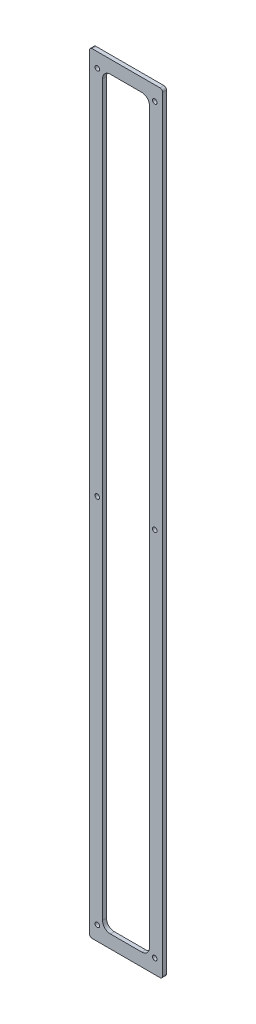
from build123d import *

# Parameters (mm, degrees)
SKETCH1_W                       = 88.9
SKETCH1_H                       = 936.752
BOSS_EXTRUDE1_DEPTH             = 4.7752
SKETCH2_W                       = 57.15
SKETCH2_H                       = 905.002
CUT_EXTRUDE1_DEPTH              = 471.50527352
F_7_32_0_21875_DIAMETER_HOLE1_D = 5.55625
FILLET1_R                       = 3.175
FILLET2_R                       = 9.525


with BuildPart() as part:
    # Sketch1 → Boss-Extrude1 (new body)
    with BuildSketch(Plane.XY):
        with Locations((0.00596135, 0)):
            Rectangle(SKETCH1_W, SKETCH1_H)
    extrude(amount=BOSS_EXTRUDE1_DEPTH)

    # Sketch2 → Cut-Extrude1 (cut, through all)
    with BuildSketch(Plane.XY.offset(4.7752)):
        Rectangle(SKETCH2_W, SKETCH2_H)
    extrude(amount=-CUT_EXTRUDE1_DEPTH, mode=Mode.SUBTRACT)

    # 7_32 _0.21875_ Diameter Hole1 (through all)
    with Locations(Plane.XY.offset(4.7752)):
        with Locations((34.93096135, -450.85), (-34.93096135, -450.85), (34.93096135, 0), (-34.93096135, 0), (34.93096135, 450.85), (-34.93096135, 450.85)):
            Hole(F_7_32_0_21875_DIAMETER_HOLE1_D / 2)

    # Fillet1
    fillet1_edges = [part.edges().sort_by_distance(p)[0] for p in [
        (-44.44403865, 468.376, 2.3876),
        (44.45596135, 468.376, 2.3876),
        (44.45596135, -468.376, 2.3876),
        (-44.44403865, -468.376, 2.3876),
    ]]
    fillet(fillet1_edges, radius=FILLET1_R)

    # Fillet2
    fillet2_edges = [part.edges().sort_by_distance(p)[0] for p in [
        (-28.575, -452.501, 2.3876),
        (-28.575, 452.501, 2.3876),
        (28.575, 452.501, 2.3876),
        (28.575, -452.501, 2.3876),
    ]]
    fillet(fillet2_edges, radius=FILLET2_R)


solid = part.part
